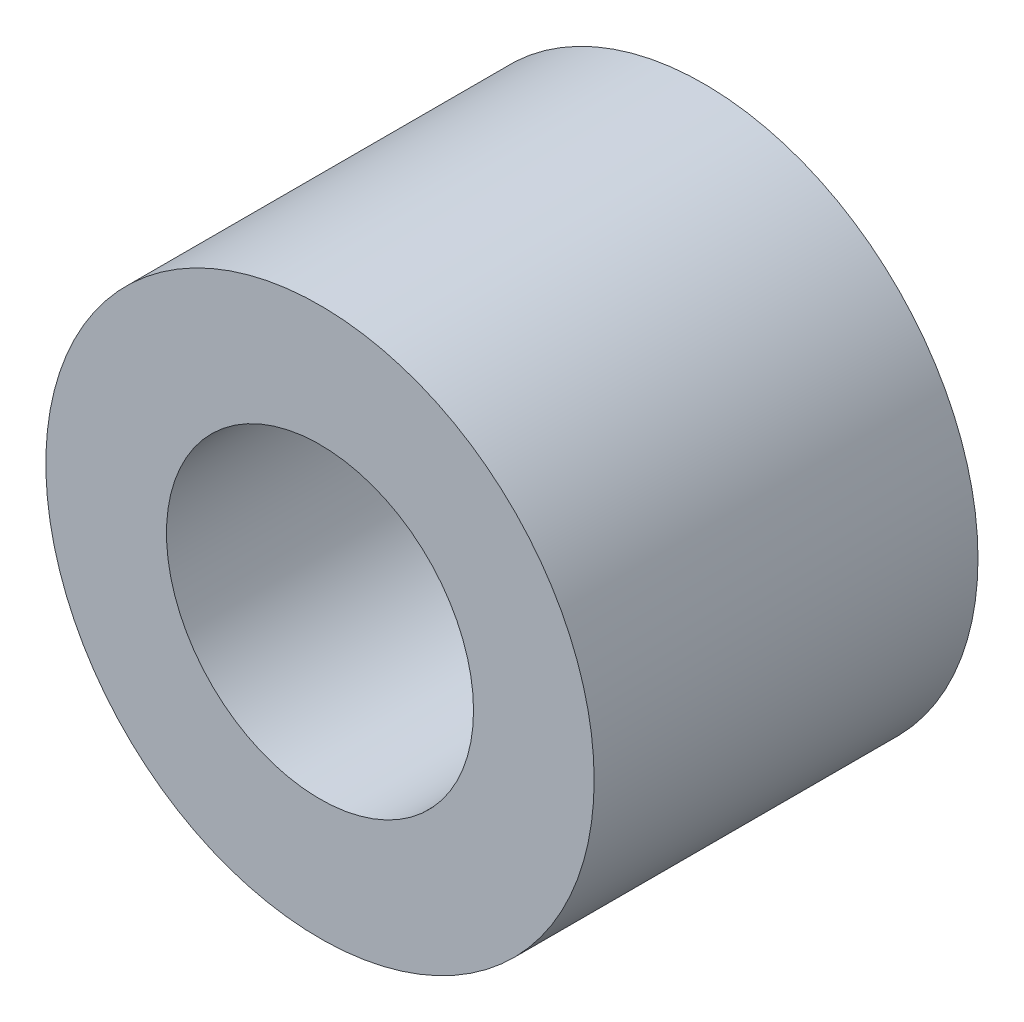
ISO-10303-21;
HEADER;
FILE_DESCRIPTION(('STEP AP214'),'2;1');
FILE_NAME('part.step','',(''),(''),'','','');
FILE_SCHEMA(('AUTOMOTIVE_DESIGN { 1 0 10303 214 1 1 1 1 }'));
ENDSEC;
DATA;
#1=APPLICATION_CONTEXT('core data for automotive mechanical design processes');
#2=APPLICATION_PROTOCOL_DEFINITION('international standard','automotive_design',2000,#1);
#3=PRODUCT_CONTEXT('',#1,'mechanical');
#4=PRODUCT('Part','Part','',(#3));
#5=PRODUCT_RELATED_PRODUCT_CATEGORY('part','',(#4));
#6=PRODUCT_DEFINITION_FORMATION('','',#4);
#7=PRODUCT_DEFINITION_CONTEXT('part definition',#1,'design');
#8=PRODUCT_DEFINITION('design','',#6,#7);
#9=PRODUCT_DEFINITION_SHAPE('','',#8);
#10=(LENGTH_UNIT() NAMED_UNIT(*) SI_UNIT(.MILLI.,.METRE.));
#11=(NAMED_UNIT(*) PLANE_ANGLE_UNIT() SI_UNIT($,.RADIAN.));
#12=(NAMED_UNIT(*) SI_UNIT($,.STERADIAN.) SOLID_ANGLE_UNIT());
#13=UNCERTAINTY_MEASURE_WITH_UNIT(LENGTH_MEASURE(1.E-05),#10,'distance_accuracy_value','');
#14=(GEOMETRIC_REPRESENTATION_CONTEXT(3) GLOBAL_UNCERTAINTY_ASSIGNED_CONTEXT((#13)) GLOBAL_UNIT_ASSIGNED_CONTEXT((#10,
#11,#12)) REPRESENTATION_CONTEXT('',''));
#15=CARTESIAN_POINT('',(0.,0.,0.));
#16=DIRECTION('',(0.,0.,1.));
#17=DIRECTION('',(1.,0.,0.));
#18=AXIS2_PLACEMENT_3D('',#15,#16,#17);
#19=CARTESIAN_POINT('',(-1.11022302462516E-13,0.,-3.556));
#20=DIRECTION('',(0.,0.,1.));
#21=DIRECTION('',(1.,0.,0.));
#22=AXIS2_PLACEMENT_3D('',#19,#20,#21);
#23=CYLINDRICAL_SURFACE('',#22,2.54);
#24=CARTESIAN_POINT('',(-1.11022302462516E-13,0.,-3.556));
#25=DIRECTION('',(0.,0.,1.));
#26=DIRECTION('',(1.,0.,0.));
#27=AXIS2_PLACEMENT_3D('',#24,#25,#26);
#28=CIRCLE('',#27,2.54);
#29=CARTESIAN_POINT('',(2.53999999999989,0.,-3.556));
#30=VERTEX_POINT('',#29);
#31=EDGE_CURVE('E10',#30,#30,#28,.T.);
#32=ORIENTED_EDGE('',*,*,#31,.T.);
#33=EDGE_LOOP('',(#32));
#34=FACE_BOUND('',#33,.T.);
#35=CARTESIAN_POINT('',(0.,0.,0.));
#36=DIRECTION('',(0.,0.,1.));
#37=DIRECTION('',(1.,0.,0.));
#38=AXIS2_PLACEMENT_3D('',#35,#36,#37);
#39=CIRCLE('',#38,2.54);
#40=CARTESIAN_POINT('',(2.54,0.,0.));
#41=VERTEX_POINT('',#40);
#42=EDGE_CURVE('E36',#41,#41,#39,.T.);
#43=ORIENTED_EDGE('',*,*,#42,.F.);
#44=EDGE_LOOP('',(#43));
#45=FACE_BOUND('',#44,.T.);
#46=ADVANCED_FACE('F30',(#34,#45),#23,.T.);
#47=CARTESIAN_POINT('',(-1.11022302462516E-13,0.,-3.556));
#48=DIRECTION('',(0.,0.,1.));
#49=DIRECTION('',(1.,0.,0.));
#50=AXIS2_PLACEMENT_3D('',#47,#48,#49);
#51=PLANE('',#50);
#52=CARTESIAN_POINT('',(-1.11022302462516E-13,0.,-3.556));
#53=DIRECTION('',(0.,0.,1.));
#54=DIRECTION('',(1.,0.,0.));
#55=AXIS2_PLACEMENT_3D('',#52,#53,#54);
#56=CIRCLE('',#55,1.42239999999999);
#57=CARTESIAN_POINT('',(1.42239999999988,0.,-3.556));
#58=VERTEX_POINT('',#57);
#59=EDGE_CURVE('E40',#58,#58,#56,.T.);
#60=ORIENTED_EDGE('',*,*,#59,.T.);
#61=EDGE_LOOP('',(#60));
#62=FACE_BOUND('',#61,.T.);
#63=ORIENTED_EDGE('',*,*,#31,.F.);
#64=EDGE_LOOP('',(#63));
#65=FACE_BOUND('',#64,.T.);
#66=ADVANCED_FACE('F54',(#62,#65),#51,.F.);
#67=CARTESIAN_POINT('',(0.,0.,0.));
#68=DIRECTION('',(0.,0.,1.));
#69=DIRECTION('',(1.,0.,0.));
#70=AXIS2_PLACEMENT_3D('',#67,#68,#69);
#71=PLANE('',#70);
#72=CARTESIAN_POINT('',(0.,0.,0.));
#73=DIRECTION('',(0.,0.,1.));
#74=DIRECTION('',(1.,0.,0.));
#75=AXIS2_PLACEMENT_3D('',#72,#73,#74);
#76=CIRCLE('',#75,1.42239999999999);
#77=CARTESIAN_POINT('',(1.42239999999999,0.,0.));
#78=VERTEX_POINT('',#77);
#79=EDGE_CURVE('E44',#78,#78,#76,.T.);
#80=ORIENTED_EDGE('',*,*,#79,.F.);
#81=EDGE_LOOP('',(#80));
#82=FACE_BOUND('',#81,.T.);
#83=ORIENTED_EDGE('',*,*,#42,.T.);
#84=EDGE_LOOP('',(#83));
#85=FACE_BOUND('',#84,.T.);
#86=ADVANCED_FACE('F52',(#82,#85),#71,.T.);
#87=CARTESIAN_POINT('',(0.,0.,0.));
#88=DIRECTION('',(0.,0.,1.));
#89=DIRECTION('',(1.,0.,0.));
#90=AXIS2_PLACEMENT_3D('',#87,#88,#89);
#91=CYLINDRICAL_SURFACE('',#90,1.42239999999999);
#92=ORIENTED_EDGE('',*,*,#59,.F.);
#93=EDGE_LOOP('',(#92));
#94=FACE_BOUND('',#93,.T.);
#95=ORIENTED_EDGE('',*,*,#79,.T.);
#96=EDGE_LOOP('',(#95));
#97=FACE_BOUND('',#96,.T.);
#98=ADVANCED_FACE('F50',(#94,#97),#91,.F.);
#99=CLOSED_SHELL('',(#46,#66,#86,#98));
#100=MANIFOLD_SOLID_BREP('B2',#99);
#101=ADVANCED_BREP_SHAPE_REPRESENTATION('',(#18,#100),#14);
#102=SHAPE_DEFINITION_REPRESENTATION(#9,#101);
ENDSEC;
END-ISO-10303-21;
